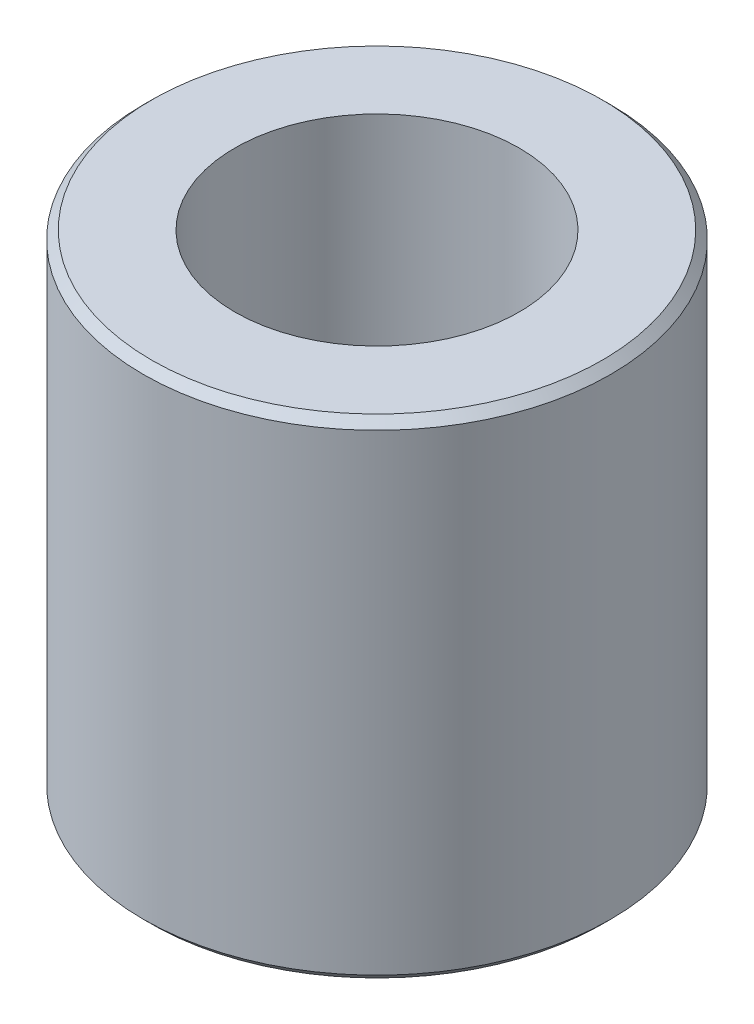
from build123d import *

# Parameters (mm, degrees)
SKETCH1_W                   = 14.351
SKETCH1_H                   = 29.9974
F_3_4_16_TAPPED_HOLE1_D     = 17.4625
F_3_4_16_TAPPED_HOLE1_DEPTH = 46.0502
F_3_4_16_TAPPED_HOLE1_TIP   = 5.24626428
CHAMFER1_SIZE               = 1.016
CUT_EXTRUDE1_DEPTH          = 11.1125
CHAMFER2_SIZE               = 0.508


with BuildPart() as part:
    # Sketch1 → Revolve1 (revolve)
    with BuildSketch(Plane.XY, mode=Mode.PRIVATE) as revolve1_sk:
        with Locations((-7.1755, -14.9987)):
            Rectangle(SKETCH1_W, SKETCH1_H)
    revolve(revolve1_sk.sketch.rotate(Axis((0, 12.490214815, 0), (0, -1, 0)), 270), axis=Axis((0, 12.490214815, 0), (0, -1, 0)))

    # 3_4-16 Tapped Hole1
    with Locations(Plane(origin=(0, 0, 0), x_dir=(1, 0, 0), z_dir=(0, 1, 0))):
        with Locations((0, 0)):
            Hole(F_3_4_16_TAPPED_HOLE1_D / 2, depth=F_3_4_16_TAPPED_HOLE1_DEPTH)
            with Locations((0, 0, -(F_3_4_16_TAPPED_HOLE1_DEPTH + F_3_4_16_TAPPED_HOLE1_TIP / 2))):  # 118° drill point
                Cone(0, F_3_4_16_TAPPED_HOLE1_D / 2, F_3_4_16_TAPPED_HOLE1_TIP, mode=Mode.SUBTRACT)

    # Sketch4 → Cut-Revolve1 (revolve, cut)
    with BuildSketch(Plane.XY, mode=Mode.PRIVATE) as cut_revolve1_sk:
        Polygon((-9.525, -29.9974), (-9.525, -16.0274), (0, -10.304202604), (0, -29.9974), align=None)
    revolve(cut_revolve1_sk.sketch.rotate(Axis((0, 4.863579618, 0), (0, -1, 0)), 270), axis=Axis((0, 4.863579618, 0), (0, -1, 0)), mode=Mode.SUBTRACT)

    # Chamfer1
    chamfer1_edges = [part.edges().sort_by_distance(p)[0] for p in [
        (0, -29.9974, -9.525),
    ]]
    chamfer(chamfer1_edges, length=CHAMFER1_SIZE)

    # Sketch5 → Cut-Extrude1 (cut)
    with BuildSketch(Plane.XZ.offset(29.9974)):
        Polygon((10.998522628, 0), (5.499261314, 9.525), (-5.499261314, 9.525), (-10.998522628, 0), (-5.499261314, -9.525), (5.499261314, -9.525), align=None)
    extrude(amount=-CUT_EXTRUDE1_DEPTH, mode=Mode.SUBTRACT)

    # Chamfer2
    chamfer2_edges = [part.edges().sort_by_distance(p)[0] for p in [
        (0, 0, -14.351),
        (0, -29.9974, -14.351),
    ]]
    chamfer(chamfer2_edges, length=CHAMFER2_SIZE)


solid = part.part
